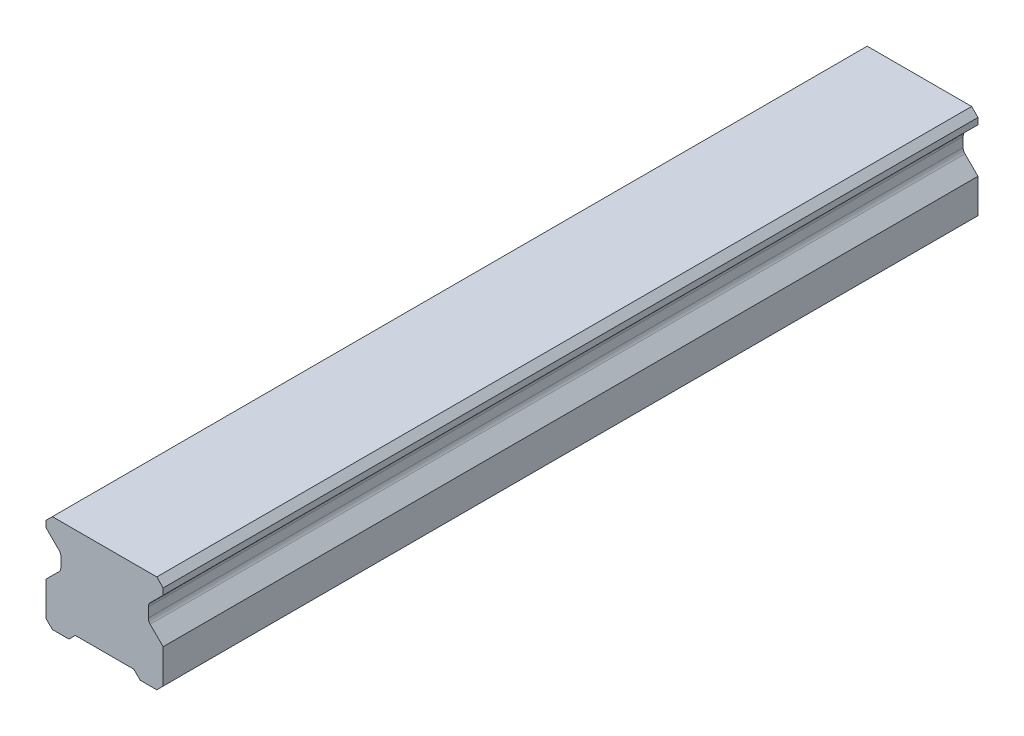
ISO-10303-21;
HEADER;
FILE_DESCRIPTION(('STEP AP214'),'2;1');
FILE_NAME('part.step','',(''),(''),'','','');
FILE_SCHEMA(('AUTOMOTIVE_DESIGN { 1 0 10303 214 1 1 1 1 }'));
ENDSEC;
DATA;
#1=APPLICATION_CONTEXT('core data for automotive mechanical design processes');
#2=APPLICATION_PROTOCOL_DEFINITION('international standard','automotive_design',2000,#1);
#3=PRODUCT_CONTEXT('',#1,'mechanical');
#4=PRODUCT('Part','Part','',(#3));
#5=PRODUCT_RELATED_PRODUCT_CATEGORY('part','',(#4));
#6=PRODUCT_DEFINITION_FORMATION('','',#4);
#7=PRODUCT_DEFINITION_CONTEXT('part definition',#1,'design');
#8=PRODUCT_DEFINITION('design','',#6,#7);
#9=PRODUCT_DEFINITION_SHAPE('','',#8);
#10=(LENGTH_UNIT() NAMED_UNIT(*) SI_UNIT(.MILLI.,.METRE.));
#11=(NAMED_UNIT(*) PLANE_ANGLE_UNIT() SI_UNIT($,.RADIAN.));
#12=(NAMED_UNIT(*) SI_UNIT($,.STERADIAN.) SOLID_ANGLE_UNIT());
#13=UNCERTAINTY_MEASURE_WITH_UNIT(LENGTH_MEASURE(1.E-05),#10,'distance_accuracy_value','');
#14=(GEOMETRIC_REPRESENTATION_CONTEXT(3) GLOBAL_UNCERTAINTY_ASSIGNED_CONTEXT((#13)) GLOBAL_UNIT_ASSIGNED_CONTEXT((#10,
#11,#12)) REPRESENTATION_CONTEXT('',''));
#15=CARTESIAN_POINT('',(0.,0.,0.));
#16=DIRECTION('',(0.,0.,1.));
#17=DIRECTION('',(1.,0.,0.));
#18=AXIS2_PLACEMENT_3D('',#15,#16,#17);
#19=CARTESIAN_POINT('',(11.5,0.,80.));
#20=DIRECTION('',(0.,1.,0.));
#21=DIRECTION('',(-1.,0.,0.));
#22=AXIS2_PLACEMENT_3D('',#19,#20,#21);
#23=PLANE('',#22);
#24=DIRECTION('',(1.,0.,0.));
#25=VECTOR('',#24,1.);
#26=CARTESIAN_POINT('',(11.5,0.,-80.));
#27=LINE('',#26,#25);
#28=CARTESIAN_POINT('',(-10.25,0.,-80.));
#29=VERTEX_POINT('',#28);
#30=CARTESIAN_POINT('',(-7.,0.,-80.));
#31=VERTEX_POINT('',#30);
#32=EDGE_CURVE('E225',#29,#31,#27,.T.);
#33=ORIENTED_EDGE('',*,*,#32,.T.);
#34=DIRECTION('',(0.,0.,1.));
#35=VECTOR('',#34,1.);
#36=CARTESIAN_POINT('',(-7.,0.,-80.));
#37=LINE('',#36,#35);
#38=CARTESIAN_POINT('',(-7.,0.,80.));
#39=VERTEX_POINT('',#38);
#40=EDGE_CURVE('E410',#31,#39,#37,.T.);
#41=ORIENTED_EDGE('',*,*,#40,.T.);
#42=DIRECTION('',(1.,0.,0.));
#43=VECTOR('',#42,1.);
#44=CARTESIAN_POINT('',(11.5,0.,80.));
#45=LINE('',#44,#43);
#46=CARTESIAN_POINT('',(-10.25,0.,80.));
#47=VERTEX_POINT('',#46);
#48=EDGE_CURVE('E425',#47,#39,#45,.T.);
#49=ORIENTED_EDGE('',*,*,#48,.F.);
#50=DIRECTION('',(0.,0.,-1.));
#51=VECTOR('',#50,1.);
#52=CARTESIAN_POINT('',(-10.25,0.,80.));
#53=LINE('',#52,#51);
#54=EDGE_CURVE('E284',#47,#29,#53,.T.);
#55=ORIENTED_EDGE('',*,*,#54,.T.);
#56=EDGE_LOOP('',(#33,#41,#49,#55));
#57=FACE_BOUND('',#56,.T.);
#58=ADVANCED_FACE('F38',(#57),#23,.F.);
#59=CARTESIAN_POINT('',(-11.5,19.2,80.));
#60=DIRECTION('',(1.,0.,0.));
#61=DIRECTION('',(0.,1.,0.));
#62=AXIS2_PLACEMENT_3D('',#59,#60,#61);
#63=PLANE('',#62);
#64=DIRECTION('',(0.,-1.,0.));
#65=VECTOR('',#64,1.);
#66=CARTESIAN_POINT('',(-11.5,19.2,80.));
#67=LINE('',#66,#65);
#68=CARTESIAN_POINT('',(-11.5,17.95,80.));
#69=VERTEX_POINT('',#68);
#70=CARTESIAN_POINT('',(-11.5,16.7,80.));
#71=VERTEX_POINT('',#70);
#72=EDGE_CURVE('E422',#69,#71,#67,.T.);
#73=ORIENTED_EDGE('',*,*,#72,.F.);
#74=DIRECTION('',(0.,0.,-1.));
#75=VECTOR('',#74,1.);
#76=CARTESIAN_POINT('',(-11.5,17.95,80.));
#77=LINE('',#76,#75);
#78=CARTESIAN_POINT('',(-11.5,17.95,-80.));
#79=VERTEX_POINT('',#78);
#80=EDGE_CURVE('E247',#69,#79,#77,.T.);
#81=ORIENTED_EDGE('',*,*,#80,.T.);
#82=DIRECTION('',(0.,-1.,0.));
#83=VECTOR('',#82,1.);
#84=CARTESIAN_POINT('',(-11.5,19.2,-80.));
#85=LINE('',#84,#83);
#86=CARTESIAN_POINT('',(-11.5,16.7,-80.));
#87=VERTEX_POINT('',#86);
#88=EDGE_CURVE('E226',#79,#87,#85,.T.);
#89=ORIENTED_EDGE('',*,*,#88,.T.);
#90=DIRECTION('',(0.,0.,1.));
#91=VECTOR('',#90,1.);
#92=CARTESIAN_POINT('',(-11.5,16.7,-80.));
#93=LINE('',#92,#91);
#94=EDGE_CURVE('E369',#87,#71,#93,.T.);
#95=ORIENTED_EDGE('',*,*,#94,.T.);
#96=EDGE_LOOP('',(#73,#81,#89,#95));
#97=FACE_BOUND('',#96,.T.);
#98=ADVANCED_FACE('F445',(#97),#63,.F.);
#99=CARTESIAN_POINT('',(11.5,19.2,80.));
#100=DIRECTION('',(-1.,0.,0.));
#101=DIRECTION('',(0.,-1.,0.));
#102=AXIS2_PLACEMENT_3D('',#99,#100,#101);
#103=PLANE('',#102);
#104=DIRECTION('',(0.,1.,0.));
#105=VECTOR('',#104,1.);
#106=CARTESIAN_POINT('',(11.5,19.2,80.));
#107=LINE('',#106,#105);
#108=CARTESIAN_POINT('',(11.5,1.25,80.));
#109=VERTEX_POINT('',#108);
#110=CARTESIAN_POINT('',(11.5,7.95,80.));
#111=VERTEX_POINT('',#110);
#112=EDGE_CURVE('E429',#109,#111,#107,.T.);
#113=ORIENTED_EDGE('',*,*,#112,.F.);
#114=DIRECTION('',(0.,0.,-1.));
#115=VECTOR('',#114,1.);
#116=CARTESIAN_POINT('',(11.5,1.25,80.));
#117=LINE('',#116,#115);
#118=CARTESIAN_POINT('',(11.5,1.25,-80.));
#119=VERTEX_POINT('',#118);
#120=EDGE_CURVE('E291',#109,#119,#117,.T.);
#121=ORIENTED_EDGE('',*,*,#120,.T.);
#122=DIRECTION('',(0.,1.,0.));
#123=VECTOR('',#122,1.);
#124=CARTESIAN_POINT('',(11.5,19.2,-80.));
#125=LINE('',#124,#123);
#126=CARTESIAN_POINT('',(11.5,7.95,-80.));
#127=VERTEX_POINT('',#126);
#128=EDGE_CURVE('E238',#119,#127,#125,.T.);
#129=ORIENTED_EDGE('',*,*,#128,.T.);
#130=DIRECTION('',(0.,0.,1.));
#131=VECTOR('',#130,1.);
#132=CARTESIAN_POINT('',(11.5,7.95,-80.));
#133=LINE('',#132,#131);
#134=EDGE_CURVE('E405',#127,#111,#133,.T.);
#135=ORIENTED_EDGE('',*,*,#134,.T.);
#136=EDGE_LOOP('',(#113,#121,#129,#135));
#137=FACE_BOUND('',#136,.T.);
#138=ADVANCED_FACE('F510',(#137),#103,.F.);
#139=CARTESIAN_POINT('',(-11.5,7.95,-80.));
#140=VERTEX_POINT('',#139);
#141=CARTESIAN_POINT('',(-11.5,1.25000000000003,-80.));
#142=VERTEX_POINT('',#141);
#143=EDGE_CURVE('E234',#140,#142,#85,.T.);
#144=ORIENTED_EDGE('',*,*,#143,.T.);
#145=DIRECTION('',(0.,0.,1.));
#146=VECTOR('',#145,1.);
#147=CARTESIAN_POINT('',(-11.5,1.25000000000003,80.));
#148=LINE('',#147,#146);
#149=CARTESIAN_POINT('',(-11.5,1.25000000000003,80.));
#150=VERTEX_POINT('',#149);
#151=EDGE_CURVE('E288',#142,#150,#148,.T.);
#152=ORIENTED_EDGE('',*,*,#151,.T.);
#153=CARTESIAN_POINT('',(-11.5,7.95,80.));
#154=VERTEX_POINT('',#153);
#155=EDGE_CURVE('E246',#154,#150,#67,.T.);
#156=ORIENTED_EDGE('',*,*,#155,.F.);
#157=DIRECTION('',(0.,0.,1.));
#158=VECTOR('',#157,1.);
#159=CARTESIAN_POINT('',(-11.5,7.95,-80.));
#160=LINE('',#159,#158);
#161=EDGE_CURVE('E388',#140,#154,#160,.T.);
#162=ORIENTED_EDGE('',*,*,#161,.F.);
#163=EDGE_LOOP('',(#144,#152,#156,#162));
#164=FACE_BOUND('',#163,.T.);
#165=ADVANCED_FACE('F496',(#164),#63,.F.);
#166=CARTESIAN_POINT('',(7.,0.,80.));
#167=VERTEX_POINT('',#166);
#168=CARTESIAN_POINT('',(10.25,0.,80.));
#169=VERTEX_POINT('',#168);
#170=EDGE_CURVE('E215',#167,#169,#45,.T.);
#171=ORIENTED_EDGE('',*,*,#170,.F.);
#172=DIRECTION('',(0.,0.,1.));
#173=VECTOR('',#172,1.);
#174=CARTESIAN_POINT('',(7.,0.,-80.));
#175=LINE('',#174,#173);
#176=CARTESIAN_POINT('',(7.,0.,-80.));
#177=VERTEX_POINT('',#176);
#178=EDGE_CURVE('E202',#177,#167,#175,.T.);
#179=ORIENTED_EDGE('',*,*,#178,.F.);
#180=CARTESIAN_POINT('',(10.25,0.,-80.));
#181=VERTEX_POINT('',#180);
#182=EDGE_CURVE('E213',#177,#181,#27,.T.);
#183=ORIENTED_EDGE('',*,*,#182,.T.);
#184=DIRECTION('',(0.,0.,1.));
#185=VECTOR('',#184,1.);
#186=CARTESIAN_POINT('',(10.25,0.,80.));
#187=LINE('',#186,#185);
#188=EDGE_CURVE('E281',#181,#169,#187,.T.);
#189=ORIENTED_EDGE('',*,*,#188,.T.);
#190=EDGE_LOOP('',(#171,#179,#183,#189));
#191=FACE_BOUND('',#190,.T.);
#192=ADVANCED_FACE('F211',(#191),#23,.F.);
#193=CARTESIAN_POINT('',(11.5,16.7,-80.));
#194=VERTEX_POINT('',#193);
#195=CARTESIAN_POINT('',(11.5,17.95,-80.));
#196=VERTEX_POINT('',#195);
#197=EDGE_CURVE('E231',#194,#196,#125,.T.);
#198=ORIENTED_EDGE('',*,*,#197,.T.);
#199=DIRECTION('',(0.,0.,1.));
#200=VECTOR('',#199,1.);
#201=CARTESIAN_POINT('',(11.5,17.95,80.));
#202=LINE('',#201,#200);
#203=CARTESIAN_POINT('',(11.5,17.95,80.));
#204=VERTEX_POINT('',#203);
#205=EDGE_CURVE('E295',#196,#204,#202,.T.);
#206=ORIENTED_EDGE('',*,*,#205,.T.);
#207=CARTESIAN_POINT('',(11.5,16.7,80.));
#208=VERTEX_POINT('',#207);
#209=EDGE_CURVE('E428',#208,#204,#107,.T.);
#210=ORIENTED_EDGE('',*,*,#209,.F.);
#211=DIRECTION('',(0.,0.,1.));
#212=VECTOR('',#211,1.);
#213=CARTESIAN_POINT('',(11.5,16.7,-80.));
#214=LINE('',#213,#212);
#215=EDGE_CURVE('E384',#194,#208,#214,.T.);
#216=ORIENTED_EDGE('',*,*,#215,.F.);
#217=EDGE_LOOP('',(#198,#206,#210,#216));
#218=FACE_BOUND('',#217,.T.);
#219=ADVANCED_FACE('F455',(#218),#103,.F.);
#220=CARTESIAN_POINT('',(11.5,19.2,80.));
#221=DIRECTION('',(0.,-1.,0.));
#222=DIRECTION('',(0.,0.,-1.));
#223=AXIS2_PLACEMENT_3D('',#220,#221,#222);
#224=PLANE('',#223);
#225=DIRECTION('',(-1.,0.,0.));
#226=VECTOR('',#225,1.);
#227=CARTESIAN_POINT('',(11.5,19.2,-80.));
#228=LINE('',#227,#226);
#229=CARTESIAN_POINT('',(10.25,19.2,-80.));
#230=VERTEX_POINT('',#229);
#231=CARTESIAN_POINT('',(-10.25,19.2,-80.));
#232=VERTEX_POINT('',#231);
#233=EDGE_CURVE('E242',#230,#232,#228,.T.);
#234=ORIENTED_EDGE('',*,*,#233,.T.);
#235=DIRECTION('',(0.,0.,1.));
#236=VECTOR('',#235,1.);
#237=CARTESIAN_POINT('',(-10.25,19.2,80.));
#238=LINE('',#237,#236);
#239=CARTESIAN_POINT('',(-10.25,19.2,80.));
#240=VERTEX_POINT('',#239);
#241=EDGE_CURVE('E267',#232,#240,#238,.T.);
#242=ORIENTED_EDGE('',*,*,#241,.T.);
#243=DIRECTION('',(-1.,0.,0.));
#244=VECTOR('',#243,1.);
#245=CARTESIAN_POINT('',(11.5,19.2,80.));
#246=LINE('',#245,#244);
#247=CARTESIAN_POINT('',(10.25,19.2,80.));
#248=VERTEX_POINT('',#247);
#249=EDGE_CURVE('E252',#248,#240,#246,.T.);
#250=ORIENTED_EDGE('',*,*,#249,.F.);
#251=DIRECTION('',(0.,0.,-1.));
#252=VECTOR('',#251,1.);
#253=CARTESIAN_POINT('',(10.25,19.2,80.));
#254=LINE('',#253,#252);
#255=EDGE_CURVE('E263',#248,#230,#254,.T.);
#256=ORIENTED_EDGE('',*,*,#255,.T.);
#257=EDGE_LOOP('',(#234,#242,#250,#256));
#258=FACE_BOUND('',#257,.T.);
#259=ADVANCED_FACE('F447',(#258),#224,.F.);
#260=CARTESIAN_POINT('',(0.,0.,80.));
#261=DIRECTION('',(0.,0.,-1.));
#262=DIRECTION('',(-1.,0.,0.));
#263=AXIS2_PLACEMENT_3D('',#260,#261,#262);
#264=PLANE('',#263);
#265=ORIENTED_EDGE('',*,*,#48,.T.);
#266=DIRECTION('',(-0.707106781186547,-0.707106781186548,0.));
#267=VECTOR('',#266,1.);
#268=CARTESIAN_POINT('',(-7.,0.,80.));
#269=LINE('',#268,#267);
#270=CARTESIAN_POINT('',(-5.75,1.25,80.));
#271=VERTEX_POINT('',#270);
#272=EDGE_CURVE('E207',#271,#39,#269,.T.);
#273=ORIENTED_EDGE('',*,*,#272,.F.);
#274=DIRECTION('',(-1.,0.,0.));
#275=VECTOR('',#274,1.);
#276=CARTESIAN_POINT('',(-5.75,1.25,80.));
#277=LINE('',#276,#275);
#278=CARTESIAN_POINT('',(5.75,1.25,80.));
#279=VERTEX_POINT('',#278);
#280=EDGE_CURVE('E473',#279,#271,#277,.T.);
#281=ORIENTED_EDGE('',*,*,#280,.F.);
#282=DIRECTION('',(-0.707106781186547,0.707106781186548,0.));
#283=VECTOR('',#282,1.);
#284=CARTESIAN_POINT('',(5.75,1.25,80.));
#285=LINE('',#284,#283);
#286=EDGE_CURVE('E470',#167,#279,#285,.T.);
#287=ORIENTED_EDGE('',*,*,#286,.F.);
#288=ORIENTED_EDGE('',*,*,#170,.T.);
#289=DIRECTION('',(-0.707106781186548,-0.707106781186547,0.));
#290=VECTOR('',#289,1.);
#291=CARTESIAN_POINT('',(11.5,1.25,80.));
#292=LINE('',#291,#290);
#293=EDGE_CURVE('E272',#169,#109,#292,.F.);
#294=ORIENTED_EDGE('',*,*,#293,.T.);
#295=ORIENTED_EDGE('',*,*,#112,.T.);
#296=DIRECTION('',(0.707106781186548,-0.707106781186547,0.));
#297=VECTOR('',#296,1.);
#298=CARTESIAN_POINT('',(11.5,7.95,80.));
#299=LINE('',#298,#297);
#300=CARTESIAN_POINT('',(8.94944985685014,10.5005501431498,80.));
#301=VERTEX_POINT('',#300);
#302=EDGE_CURVE('E406',#301,#111,#299,.T.);
#303=ORIENTED_EDGE('',*,*,#302,.F.);
#304=CARTESIAN_POINT('',(9.83333333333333,11.384433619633,80.));
#305=DIRECTION('',(0.,0.,-1.));
#306=DIRECTION('',(-1.,0.,0.));
#307=AXIS2_PLACEMENT_3D('',#304,#305,#306);
#308=CIRCLE('',#307,1.25);
#309=CARTESIAN_POINT('',(8.58333333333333,11.384433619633,80.));
#310=VERTEX_POINT('',#309);
#311=EDGE_CURVE('E326',#301,#310,#308,.T.);
#312=ORIENTED_EDGE('',*,*,#311,.T.);
#313=DIRECTION('',(0.,-1.,0.));
#314=VECTOR('',#313,1.);
#315=CARTESIAN_POINT('',(8.58333333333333,10.8666666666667,80.));
#316=LINE('',#315,#314);
#317=CARTESIAN_POINT('',(8.58333333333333,13.265566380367,80.));
#318=VERTEX_POINT('',#317);
#319=EDGE_CURVE('E397',#318,#310,#316,.T.);
#320=ORIENTED_EDGE('',*,*,#319,.F.);
#321=CARTESIAN_POINT('',(9.83333333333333,13.265566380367,80.));
#322=DIRECTION('',(0.,0.,-1.));
#323=DIRECTION('',(-1.,0.,0.));
#324=AXIS2_PLACEMENT_3D('',#321,#322,#323);
#325=CIRCLE('',#324,1.25);
#326=CARTESIAN_POINT('',(8.94944985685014,14.1494498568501,80.));
#327=VERTEX_POINT('',#326);
#328=EDGE_CURVE('E332',#318,#327,#325,.T.);
#329=ORIENTED_EDGE('',*,*,#328,.T.);
#330=DIRECTION('',(-0.707106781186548,-0.707106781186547,0.));
#331=VECTOR('',#330,1.);
#332=CARTESIAN_POINT('',(8.58333333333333,13.7833333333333,80.));
#333=LINE('',#332,#331);
#334=EDGE_CURVE('E409',#208,#327,#333,.T.);
#335=ORIENTED_EDGE('',*,*,#334,.F.);
#336=ORIENTED_EDGE('',*,*,#209,.T.);
#337=DIRECTION('',(0.707106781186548,-0.707106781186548,0.));
#338=VECTOR('',#337,1.);
#339=CARTESIAN_POINT('',(10.25,19.2,80.));
#340=LINE('',#339,#338);
#341=EDGE_CURVE('E269',#204,#248,#340,.F.);
#342=ORIENTED_EDGE('',*,*,#341,.T.);
#343=ORIENTED_EDGE('',*,*,#249,.T.);
#344=DIRECTION('',(0.707106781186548,0.707106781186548,0.));
#345=VECTOR('',#344,1.);
#346=CARTESIAN_POINT('',(-11.5,17.95,80.));
#347=LINE('',#346,#345);
#348=EDGE_CURVE('E278',#240,#69,#347,.F.);
#349=ORIENTED_EDGE('',*,*,#348,.T.);
#350=ORIENTED_EDGE('',*,*,#72,.T.);
#351=DIRECTION('',(-0.707106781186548,0.707106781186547,0.));
#352=VECTOR('',#351,1.);
#353=CARTESIAN_POINT('',(-8.58333333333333,13.7833333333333,80.));
#354=LINE('',#353,#352);
#355=CARTESIAN_POINT('',(-8.94944985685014,14.1494498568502,80.));
#356=VERTEX_POINT('',#355);
#357=EDGE_CURVE('E353',#356,#71,#354,.T.);
#358=ORIENTED_EDGE('',*,*,#357,.F.);
#359=CARTESIAN_POINT('',(-9.83333333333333,13.265566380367,80.));
#360=DIRECTION('',(0.,0.,-1.));
#361=DIRECTION('',(-1.,0.,0.));
#362=AXIS2_PLACEMENT_3D('',#359,#360,#361);
#363=CIRCLE('',#362,1.25);
#364=CARTESIAN_POINT('',(-8.58333333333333,13.265566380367,80.));
#365=VERTEX_POINT('',#364);
#366=EDGE_CURVE('E47',#356,#365,#363,.T.);
#367=ORIENTED_EDGE('',*,*,#366,.T.);
#368=DIRECTION('',(0.,1.,0.));
#369=VECTOR('',#368,1.);
#370=CARTESIAN_POINT('',(-8.58333333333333,10.8666666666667,80.));
#371=LINE('',#370,#369);
#372=CARTESIAN_POINT('',(-8.58333333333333,11.384433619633,80.));
#373=VERTEX_POINT('',#372);
#374=EDGE_CURVE('E351',#373,#365,#371,.T.);
#375=ORIENTED_EDGE('',*,*,#374,.F.);
#376=CARTESIAN_POINT('',(-9.83333333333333,11.384433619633,80.));
#377=DIRECTION('',(0.,0.,-1.));
#378=DIRECTION('',(-1.,0.,0.));
#379=AXIS2_PLACEMENT_3D('',#376,#377,#378);
#380=CIRCLE('',#379,1.25);
#381=CARTESIAN_POINT('',(-8.94944985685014,10.5005501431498,80.));
#382=VERTEX_POINT('',#381);
#383=EDGE_CURVE('E338',#373,#382,#380,.T.);
#384=ORIENTED_EDGE('',*,*,#383,.T.);
#385=DIRECTION('',(0.707106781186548,0.707106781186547,0.));
#386=VECTOR('',#385,1.);
#387=CARTESIAN_POINT('',(-11.5,7.95,80.));
#388=LINE('',#387,#386);
#389=EDGE_CURVE('E363',#154,#382,#388,.T.);
#390=ORIENTED_EDGE('',*,*,#389,.F.);
#391=ORIENTED_EDGE('',*,*,#155,.T.);
#392=DIRECTION('',(-0.707106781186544,0.707106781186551,0.));
#393=VECTOR('',#392,1.);
#394=CARTESIAN_POINT('',(-10.25,0.,80.));
#395=LINE('',#394,#393);
#396=EDGE_CURVE('E275',#150,#47,#395,.F.);
#397=ORIENTED_EDGE('',*,*,#396,.T.);
#398=EDGE_LOOP('',(#265,#273,#281,#287,#288,#294,#295,#303,#312,#320,#329,#335,#336,#342,#343,
#349,#350,#358,#367,#375,#384,#390,#391,#397));
#399=FACE_BOUND('',#398,.T.);
#400=ADVANCED_FACE('F350',(#399),#264,.F.);
#401=CARTESIAN_POINT('',(0.,0.,-80.));
#402=DIRECTION('',(0.,0.,-1.));
#403=DIRECTION('',(-1.,0.,0.));
#404=AXIS2_PLACEMENT_3D('',#401,#402,#403);
#405=PLANE('',#404);
#406=DIRECTION('',(-0.707106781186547,-0.707106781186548,0.));
#407=VECTOR('',#406,1.);
#408=CARTESIAN_POINT('',(-7.,0.,-80.));
#409=LINE('',#408,#407);
#410=CARTESIAN_POINT('',(-5.75,1.25,-80.));
#411=VERTEX_POINT('',#410);
#412=EDGE_CURVE('E217',#411,#31,#409,.T.);
#413=ORIENTED_EDGE('',*,*,#412,.T.);
#414=ORIENTED_EDGE('',*,*,#32,.F.);
#415=DIRECTION('',(0.707106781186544,-0.707106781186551,0.));
#416=VECTOR('',#415,1.);
#417=CARTESIAN_POINT('',(-5.12500000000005,-5.12499999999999,-80.));
#418=LINE('',#417,#416);
#419=EDGE_CURVE('E257',#29,#142,#418,.F.);
#420=ORIENTED_EDGE('',*,*,#419,.T.);
#421=ORIENTED_EDGE('',*,*,#143,.F.);
#422=DIRECTION('',(0.707106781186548,0.707106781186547,0.));
#423=VECTOR('',#422,1.);
#424=CARTESIAN_POINT('',(-11.5,7.95,-80.));
#425=LINE('',#424,#423);
#426=CARTESIAN_POINT('',(-8.94944985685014,10.5005501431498,-80.));
#427=VERTEX_POINT('',#426);
#428=EDGE_CURVE('E372',#140,#427,#425,.T.);
#429=ORIENTED_EDGE('',*,*,#428,.T.);
#430=CARTESIAN_POINT('',(-9.83333333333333,11.384433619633,-80.));
#431=DIRECTION('',(0.,0.,-1.));
#432=DIRECTION('',(-1.,0.,0.));
#433=AXIS2_PLACEMENT_3D('',#430,#431,#432);
#434=CIRCLE('',#433,1.25);
#435=CARTESIAN_POINT('',(-8.58333333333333,11.384433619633,-80.));
#436=VERTEX_POINT('',#435);
#437=EDGE_CURVE('E341',#427,#436,#434,.F.);
#438=ORIENTED_EDGE('',*,*,#437,.T.);
#439=DIRECTION('',(0.,1.,0.));
#440=VECTOR('',#439,1.);
#441=CARTESIAN_POINT('',(-8.58333333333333,10.8666666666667,-80.));
#442=LINE('',#441,#440);
#443=CARTESIAN_POINT('',(-8.58333333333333,13.265566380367,-80.));
#444=VERTEX_POINT('',#443);
#445=EDGE_CURVE('E376',#436,#444,#442,.T.);
#446=ORIENTED_EDGE('',*,*,#445,.T.);
#447=CARTESIAN_POINT('',(-9.83333333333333,13.265566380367,-80.));
#448=DIRECTION('',(0.,0.,-1.));
#449=DIRECTION('',(-1.,0.,0.));
#450=AXIS2_PLACEMENT_3D('',#447,#448,#449);
#451=CIRCLE('',#450,1.25);
#452=CARTESIAN_POINT('',(-8.94944985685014,14.1494498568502,-80.));
#453=VERTEX_POINT('',#452);
#454=EDGE_CURVE('E11',#444,#453,#451,.F.);
#455=ORIENTED_EDGE('',*,*,#454,.T.);
#456=DIRECTION('',(-0.707106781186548,0.707106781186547,0.));
#457=VECTOR('',#456,1.);
#458=CARTESIAN_POINT('',(-8.58333333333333,13.7833333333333,-80.));
#459=LINE('',#458,#457);
#460=EDGE_CURVE('E362',#453,#87,#459,.T.);
#461=ORIENTED_EDGE('',*,*,#460,.T.);
#462=ORIENTED_EDGE('',*,*,#88,.F.);
#463=DIRECTION('',(-0.707106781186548,-0.707106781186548,0.));
#464=VECTOR('',#463,1.);
#465=CARTESIAN_POINT('',(-14.725,14.725,-80.));
#466=LINE('',#465,#464);
#467=EDGE_CURVE('E260',#79,#232,#466,.F.);
#468=ORIENTED_EDGE('',*,*,#467,.T.);
#469=ORIENTED_EDGE('',*,*,#233,.F.);
#470=DIRECTION('',(-0.707106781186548,0.707106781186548,0.));
#471=VECTOR('',#470,1.);
#472=CARTESIAN_POINT('',(14.725,14.725,-80.));
#473=LINE('',#472,#471);
#474=EDGE_CURVE('E251',#230,#196,#473,.F.);
#475=ORIENTED_EDGE('',*,*,#474,.T.);
#476=ORIENTED_EDGE('',*,*,#197,.F.);
#477=DIRECTION('',(-0.707106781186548,-0.707106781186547,0.));
#478=VECTOR('',#477,1.);
#479=CARTESIAN_POINT('',(8.58333333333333,13.7833333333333,-80.));
#480=LINE('',#479,#478);
#481=CARTESIAN_POINT('',(8.94944985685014,14.1494498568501,-80.));
#482=VERTEX_POINT('',#481);
#483=EDGE_CURVE('E396',#194,#482,#480,.T.);
#484=ORIENTED_EDGE('',*,*,#483,.T.);
#485=CARTESIAN_POINT('',(9.83333333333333,13.265566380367,-80.));
#486=DIRECTION('',(0.,0.,-1.));
#487=DIRECTION('',(-1.,0.,0.));
#488=AXIS2_PLACEMENT_3D('',#485,#486,#487);
#489=CIRCLE('',#488,1.25);
#490=CARTESIAN_POINT('',(8.58333333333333,13.265566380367,-80.));
#491=VERTEX_POINT('',#490);
#492=EDGE_CURVE('E335',#482,#491,#489,.F.);
#493=ORIENTED_EDGE('',*,*,#492,.T.);
#494=DIRECTION('',(0.,-1.,0.));
#495=VECTOR('',#494,1.);
#496=CARTESIAN_POINT('',(8.58333333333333,10.8666666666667,-80.));
#497=LINE('',#496,#495);
#498=CARTESIAN_POINT('',(8.58333333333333,11.384433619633,-80.));
#499=VERTEX_POINT('',#498);
#500=EDGE_CURVE('E401',#491,#499,#497,.T.);
#501=ORIENTED_EDGE('',*,*,#500,.T.);
#502=CARTESIAN_POINT('',(9.83333333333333,11.384433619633,-80.));
#503=DIRECTION('',(0.,0.,-1.));
#504=DIRECTION('',(-1.,0.,0.));
#505=AXIS2_PLACEMENT_3D('',#502,#503,#504);
#506=CIRCLE('',#505,1.25);
#507=CARTESIAN_POINT('',(8.94944985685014,10.5005501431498,-80.));
#508=VERTEX_POINT('',#507);
#509=EDGE_CURVE('E329',#499,#508,#506,.F.);
#510=ORIENTED_EDGE('',*,*,#509,.T.);
#511=DIRECTION('',(0.707106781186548,-0.707106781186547,0.));
#512=VECTOR('',#511,1.);
#513=CARTESIAN_POINT('',(11.5,7.95,-80.));
#514=LINE('',#513,#512);
#515=EDGE_CURVE('E393',#508,#127,#514,.T.);
#516=ORIENTED_EDGE('',*,*,#515,.T.);
#517=ORIENTED_EDGE('',*,*,#128,.F.);
#518=DIRECTION('',(0.707106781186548,0.707106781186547,0.));
#519=VECTOR('',#518,1.);
#520=CARTESIAN_POINT('',(5.125,-5.125,-80.));
#521=LINE('',#520,#519);
#522=EDGE_CURVE('E222',#119,#181,#521,.F.);
#523=ORIENTED_EDGE('',*,*,#522,.T.);
#524=ORIENTED_EDGE('',*,*,#182,.F.);
#525=DIRECTION('',(-0.707106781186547,0.707106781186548,0.));
#526=VECTOR('',#525,1.);
#527=CARTESIAN_POINT('',(5.75,1.25,-80.));
#528=LINE('',#527,#526);
#529=CARTESIAN_POINT('',(5.75,1.25,-80.));
#530=VERTEX_POINT('',#529);
#531=EDGE_CURVE('E198',#177,#530,#528,.T.);
#532=ORIENTED_EDGE('',*,*,#531,.T.);
#533=DIRECTION('',(-1.,0.,0.));
#534=VECTOR('',#533,1.);
#535=CARTESIAN_POINT('',(-5.75,1.25,-80.));
#536=LINE('',#535,#534);
#537=EDGE_CURVE('E54',#530,#411,#536,.T.);
#538=ORIENTED_EDGE('',*,*,#537,.T.);
#539=EDGE_LOOP('',(#413,#414,#420,#421,#429,#438,#446,#455,#461,#462,#468,#469,#475,#476,#484,
#493,#501,#510,#516,#517,#523,#524,#532,#538));
#540=FACE_BOUND('',#539,.T.);
#541=ADVANCED_FACE('F220',(#540),#405,.T.);
#542=CARTESIAN_POINT('',(11.5,7.95,-80.));
#543=DIRECTION('',(-0.707106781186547,-0.707106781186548,0.));
#544=DIRECTION('',(0.707106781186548,-0.707106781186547,0.));
#545=AXIS2_PLACEMENT_3D('',#542,#543,#544);
#546=PLANE('',#545);
#547=ORIENTED_EDGE('',*,*,#515,.F.);
#548=DIRECTION('',(0.,0.,1.));
#549=VECTOR('',#548,1.);
#550=CARTESIAN_POINT('',(8.94944985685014,10.5005501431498,80.));
#551=LINE('',#550,#549);
#552=EDGE_CURVE('E298',#508,#301,#551,.T.);
#553=ORIENTED_EDGE('',*,*,#552,.T.);
#554=ORIENTED_EDGE('',*,*,#302,.T.);
#555=ORIENTED_EDGE('',*,*,#134,.F.);
#556=EDGE_LOOP('',(#547,#553,#554,#555));
#557=FACE_BOUND('',#556,.T.);
#558=ADVANCED_FACE('F516',(#557),#546,.F.);
#559=CARTESIAN_POINT('',(8.58333333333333,10.8666666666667,-80.));
#560=DIRECTION('',(-1.,0.,0.));
#561=DIRECTION('',(0.,0.,1.));
#562=AXIS2_PLACEMENT_3D('',#559,#560,#561);
#563=PLANE('',#562);
#564=ORIENTED_EDGE('',*,*,#319,.T.);
#565=DIRECTION('',(0.,0.,1.));
#566=VECTOR('',#565,1.);
#567=CARTESIAN_POINT('',(8.58333333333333,11.384433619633,-80.));
#568=LINE('',#567,#566);
#569=EDGE_CURVE('E306',#310,#499,#568,.F.);
#570=ORIENTED_EDGE('',*,*,#569,.T.);
#571=ORIENTED_EDGE('',*,*,#500,.F.);
#572=DIRECTION('',(0.,0.,1.));
#573=VECTOR('',#572,1.);
#574=CARTESIAN_POINT('',(8.58333333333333,13.265566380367,80.));
#575=LINE('',#574,#573);
#576=EDGE_CURVE('E302',#491,#318,#575,.T.);
#577=ORIENTED_EDGE('',*,*,#576,.T.);
#578=EDGE_LOOP('',(#564,#570,#571,#577));
#579=FACE_BOUND('',#578,.T.);
#580=ADVANCED_FACE('F523',(#579),#563,.F.);
#581=CARTESIAN_POINT('',(8.58333333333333,13.7833333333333,-80.));
#582=DIRECTION('',(-0.707106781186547,0.707106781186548,0.));
#583=DIRECTION('',(-0.707106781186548,-0.707106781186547,0.));
#584=AXIS2_PLACEMENT_3D('',#581,#582,#583);
#585=PLANE('',#584);
#586=ORIENTED_EDGE('',*,*,#334,.T.);
#587=DIRECTION('',(0.,0.,1.));
#588=VECTOR('',#587,1.);
#589=CARTESIAN_POINT('',(8.94944985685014,14.1494498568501,-80.));
#590=LINE('',#589,#588);
#591=EDGE_CURVE('E309',#327,#482,#590,.F.);
#592=ORIENTED_EDGE('',*,*,#591,.T.);
#593=ORIENTED_EDGE('',*,*,#483,.F.);
#594=ORIENTED_EDGE('',*,*,#215,.T.);
#595=EDGE_LOOP('',(#586,#592,#593,#594));
#596=FACE_BOUND('',#595,.T.);
#597=ADVANCED_FACE('F532',(#596),#585,.F.);
#598=CARTESIAN_POINT('',(-8.58333333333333,13.7833333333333,-80.));
#599=DIRECTION('',(0.707106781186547,0.707106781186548,0.));
#600=DIRECTION('',(-0.707106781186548,0.707106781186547,0.));
#601=AXIS2_PLACEMENT_3D('',#598,#599,#600);
#602=PLANE('',#601);
#603=ORIENTED_EDGE('',*,*,#460,.F.);
#604=DIRECTION('',(0.,0.,1.));
#605=VECTOR('',#604,1.);
#606=CARTESIAN_POINT('',(-8.94944985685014,14.1494498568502,80.));
#607=LINE('',#606,#605);
#608=EDGE_CURVE('E322',#453,#356,#607,.T.);
#609=ORIENTED_EDGE('',*,*,#608,.T.);
#610=ORIENTED_EDGE('',*,*,#357,.T.);
#611=ORIENTED_EDGE('',*,*,#94,.F.);
#612=EDGE_LOOP('',(#603,#609,#610,#611));
#613=FACE_BOUND('',#612,.T.);
#614=ADVANCED_FACE('F366',(#613),#602,.F.);
#615=CARTESIAN_POINT('',(-8.58333333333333,10.8666666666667,-80.));
#616=DIRECTION('',(1.,0.,0.));
#617=DIRECTION('',(0.,1.,0.));
#618=AXIS2_PLACEMENT_3D('',#615,#616,#617);
#619=PLANE('',#618);
#620=ORIENTED_EDGE('',*,*,#445,.F.);
#621=DIRECTION('',(0.,0.,1.));
#622=VECTOR('',#621,1.);
#623=CARTESIAN_POINT('',(-8.58333333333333,11.384433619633,80.));
#624=LINE('',#623,#622);
#625=EDGE_CURVE('E315',#436,#373,#624,.T.);
#626=ORIENTED_EDGE('',*,*,#625,.T.);
#627=ORIENTED_EDGE('',*,*,#374,.T.);
#628=DIRECTION('',(0.,0.,1.));
#629=VECTOR('',#628,1.);
#630=CARTESIAN_POINT('',(-8.58333333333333,13.265566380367,-80.));
#631=LINE('',#630,#629);
#632=EDGE_CURVE('E312',#365,#444,#631,.F.);
#633=ORIENTED_EDGE('',*,*,#632,.T.);
#634=EDGE_LOOP('',(#620,#626,#627,#633));
#635=FACE_BOUND('',#634,.T.);
#636=ADVANCED_FACE('F359',(#635),#619,.F.);
#637=CARTESIAN_POINT('',(-11.5,7.95,-80.));
#638=DIRECTION('',(0.707106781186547,-0.707106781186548,0.));
#639=DIRECTION('',(0.707106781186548,0.707106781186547,0.));
#640=AXIS2_PLACEMENT_3D('',#637,#638,#639);
#641=PLANE('',#640);
#642=ORIENTED_EDGE('',*,*,#389,.T.);
#643=DIRECTION('',(0.,0.,1.));
#644=VECTOR('',#643,1.);
#645=CARTESIAN_POINT('',(-8.94944985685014,10.5005501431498,-80.));
#646=LINE('',#645,#644);
#647=EDGE_CURVE('E319',#382,#427,#646,.F.);
#648=ORIENTED_EDGE('',*,*,#647,.T.);
#649=ORIENTED_EDGE('',*,*,#428,.F.);
#650=ORIENTED_EDGE('',*,*,#161,.T.);
#651=EDGE_LOOP('',(#642,#648,#649,#650));
#652=FACE_BOUND('',#651,.T.);
#653=ADVANCED_FACE('F560',(#652),#641,.F.);
#654=CARTESIAN_POINT('',(-11.5,17.95,80.));
#655=DIRECTION('',(0.707106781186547,-0.707106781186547,0.));
#656=DIRECTION('',(0.,0.,-1.));
#657=AXIS2_PLACEMENT_3D('',#654,#655,#656);
#658=PLANE('',#657);
#659=ORIENTED_EDGE('',*,*,#348,.F.);
#660=ORIENTED_EDGE('',*,*,#241,.F.);
#661=ORIENTED_EDGE('',*,*,#467,.F.);
#662=ORIENTED_EDGE('',*,*,#80,.F.);
#663=EDGE_LOOP('',(#659,#660,#661,#662));
#664=FACE_BOUND('',#663,.T.);
#665=ADVANCED_FACE('F443',(#664),#658,.F.);
#666=CARTESIAN_POINT('',(-10.25,0.,80.));
#667=DIRECTION('',(0.707106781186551,0.707106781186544,0.));
#668=DIRECTION('',(0.,0.,-1.));
#669=AXIS2_PLACEMENT_3D('',#666,#667,#668);
#670=PLANE('',#669);
#671=ORIENTED_EDGE('',*,*,#396,.F.);
#672=ORIENTED_EDGE('',*,*,#151,.F.);
#673=ORIENTED_EDGE('',*,*,#419,.F.);
#674=ORIENTED_EDGE('',*,*,#54,.F.);
#675=EDGE_LOOP('',(#671,#672,#673,#674));
#676=FACE_BOUND('',#675,.T.);
#677=ADVANCED_FACE('F500',(#676),#670,.F.);
#678=CARTESIAN_POINT('',(11.5,1.25,80.));
#679=DIRECTION('',(-0.707106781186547,0.707106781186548,0.));
#680=DIRECTION('',(0.,0.,-1.));
#681=AXIS2_PLACEMENT_3D('',#678,#679,#680);
#682=PLANE('',#681);
#683=ORIENTED_EDGE('',*,*,#293,.F.);
#684=ORIENTED_EDGE('',*,*,#188,.F.);
#685=ORIENTED_EDGE('',*,*,#522,.F.);
#686=ORIENTED_EDGE('',*,*,#120,.F.);
#687=EDGE_LOOP('',(#683,#684,#685,#686));
#688=FACE_BOUND('',#687,.T.);
#689=ADVANCED_FACE('F508',(#688),#682,.F.);
#690=CARTESIAN_POINT('',(10.25,19.2,80.));
#691=DIRECTION('',(-0.707106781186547,-0.707106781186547,0.));
#692=DIRECTION('',(0.,0.,-1.));
#693=AXIS2_PLACEMENT_3D('',#690,#691,#692);
#694=PLANE('',#693);
#695=ORIENTED_EDGE('',*,*,#341,.F.);
#696=ORIENTED_EDGE('',*,*,#205,.F.);
#697=ORIENTED_EDGE('',*,*,#474,.F.);
#698=ORIENTED_EDGE('',*,*,#255,.F.);
#699=EDGE_LOOP('',(#695,#696,#697,#698));
#700=FACE_BOUND('',#699,.T.);
#701=ADVANCED_FACE('F449',(#700),#694,.F.);
#702=CARTESIAN_POINT('',(9.83333333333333,11.384433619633,-80.));
#703=DIRECTION('',(0.,0.,-1.));
#704=DIRECTION('',(-1.,0.,0.));
#705=AXIS2_PLACEMENT_3D('',#702,#703,#704);
#706=CYLINDRICAL_SURFACE('',#705,1.25);
#707=ORIENTED_EDGE('',*,*,#509,.F.);
#708=ORIENTED_EDGE('',*,*,#569,.F.);
#709=ORIENTED_EDGE('',*,*,#311,.F.);
#710=ORIENTED_EDGE('',*,*,#552,.F.);
#711=EDGE_LOOP('',(#707,#708,#709,#710));
#712=FACE_BOUND('',#711,.T.);
#713=ADVANCED_FACE('F519',(#712),#706,.F.);
#714=CARTESIAN_POINT('',(9.83333333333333,13.265566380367,-80.));
#715=DIRECTION('',(0.,0.,-1.));
#716=DIRECTION('',(-1.,0.,0.));
#717=AXIS2_PLACEMENT_3D('',#714,#715,#716);
#718=CYLINDRICAL_SURFACE('',#717,1.25);
#719=ORIENTED_EDGE('',*,*,#492,.F.);
#720=ORIENTED_EDGE('',*,*,#591,.F.);
#721=ORIENTED_EDGE('',*,*,#328,.F.);
#722=ORIENTED_EDGE('',*,*,#576,.F.);
#723=EDGE_LOOP('',(#719,#720,#721,#722));
#724=FACE_BOUND('',#723,.T.);
#725=ADVANCED_FACE('F528',(#724),#718,.F.);
#726=CARTESIAN_POINT('',(-9.83333333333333,11.384433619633,-80.));
#727=DIRECTION('',(0.,0.,-1.));
#728=DIRECTION('',(-1.,0.,0.));
#729=AXIS2_PLACEMENT_3D('',#726,#727,#728);
#730=CYLINDRICAL_SURFACE('',#729,1.25);
#731=ORIENTED_EDGE('',*,*,#437,.F.);
#732=ORIENTED_EDGE('',*,*,#647,.F.);
#733=ORIENTED_EDGE('',*,*,#383,.F.);
#734=ORIENTED_EDGE('',*,*,#625,.F.);
#735=EDGE_LOOP('',(#731,#732,#733,#734));
#736=FACE_BOUND('',#735,.T.);
#737=ADVANCED_FACE('F570',(#736),#730,.F.);
#738=CARTESIAN_POINT('',(-9.83333333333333,13.265566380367,-80.));
#739=DIRECTION('',(0.,0.,-1.));
#740=DIRECTION('',(-1.,0.,0.));
#741=AXIS2_PLACEMENT_3D('',#738,#739,#740);
#742=CYLINDRICAL_SURFACE('',#741,1.25);
#743=ORIENTED_EDGE('',*,*,#454,.F.);
#744=ORIENTED_EDGE('',*,*,#632,.F.);
#745=ORIENTED_EDGE('',*,*,#366,.F.);
#746=ORIENTED_EDGE('',*,*,#608,.F.);
#747=EDGE_LOOP('',(#743,#744,#745,#746));
#748=FACE_BOUND('',#747,.T.);
#749=ADVANCED_FACE('F40',(#748),#742,.F.);
#750=CARTESIAN_POINT('',(-7.,0.,-80.));
#751=DIRECTION('',(-0.707106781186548,0.707106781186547,0.));
#752=DIRECTION('',(-0.707106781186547,-0.707106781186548,0.));
#753=AXIS2_PLACEMENT_3D('',#750,#751,#752);
#754=PLANE('',#753);
#755=ORIENTED_EDGE('',*,*,#272,.T.);
#756=ORIENTED_EDGE('',*,*,#40,.F.);
#757=ORIENTED_EDGE('',*,*,#412,.F.);
#758=DIRECTION('',(0.,0.,1.));
#759=VECTOR('',#758,1.);
#760=CARTESIAN_POINT('',(-5.75,1.25,-80.));
#761=LINE('',#760,#759);
#762=EDGE_CURVE('E464',#411,#271,#761,.T.);
#763=ORIENTED_EDGE('',*,*,#762,.T.);
#764=EDGE_LOOP('',(#755,#756,#757,#763));
#765=FACE_BOUND('',#764,.T.);
#766=ADVANCED_FACE('F486',(#765),#754,.F.);
#767=CARTESIAN_POINT('',(-5.75,1.25,-80.));
#768=DIRECTION('',(0.,1.,0.));
#769=DIRECTION('',(0.,0.,1.));
#770=AXIS2_PLACEMENT_3D('',#767,#768,#769);
#771=PLANE('',#770);
#772=ORIENTED_EDGE('',*,*,#280,.T.);
#773=ORIENTED_EDGE('',*,*,#762,.F.);
#774=ORIENTED_EDGE('',*,*,#537,.F.);
#775=DIRECTION('',(0.,0.,1.));
#776=VECTOR('',#775,1.);
#777=CARTESIAN_POINT('',(5.75,1.25,-80.));
#778=LINE('',#777,#776);
#779=EDGE_CURVE('E204',#530,#279,#778,.T.);
#780=ORIENTED_EDGE('',*,*,#779,.T.);
#781=EDGE_LOOP('',(#772,#773,#774,#780));
#782=FACE_BOUND('',#781,.T.);
#783=ADVANCED_FACE('F481',(#782),#771,.F.);
#784=CARTESIAN_POINT('',(5.75,1.25,-80.));
#785=DIRECTION('',(0.707106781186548,0.707106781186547,0.));
#786=DIRECTION('',(-0.707106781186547,0.707106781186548,0.));
#787=AXIS2_PLACEMENT_3D('',#784,#785,#786);
#788=PLANE('',#787);
#789=ORIENTED_EDGE('',*,*,#286,.T.);
#790=ORIENTED_EDGE('',*,*,#779,.F.);
#791=ORIENTED_EDGE('',*,*,#531,.F.);
#792=ORIENTED_EDGE('',*,*,#178,.T.);
#793=EDGE_LOOP('',(#789,#790,#791,#792));
#794=FACE_BOUND('',#793,.T.);
#795=ADVANCED_FACE('F201',(#794),#788,.F.);
#796=CLOSED_SHELL('',(#58,#98,#138,#165,#192,#219,#259,#400,#541,#558,#580,#597,#614,#636,#653,
#665,#677,#689,#701,#713,#725,#737,#749,#766,#783,#795));
#797=MANIFOLD_SOLID_BREP('B2',#796);
#798=ADVANCED_BREP_SHAPE_REPRESENTATION('',(#18,#797),#14);
#799=SHAPE_DEFINITION_REPRESENTATION(#9,#798);
ENDSEC;
END-ISO-10303-21;
